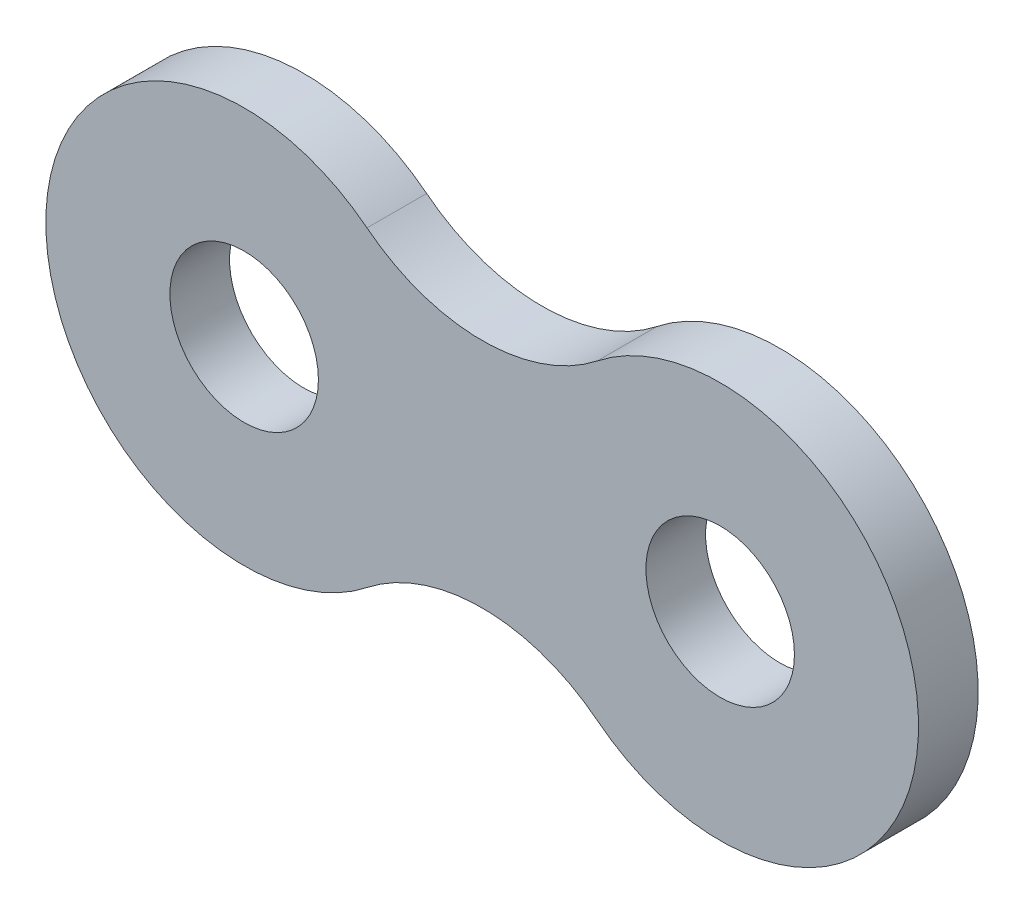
from build123d import *

# Parameters (mm, degrees)
SKETCH3_R          = 2.9718
BASE_EXTRUDE_DEPTH = 2.3876


with BuildPart() as part:
    # Sketch3 → Base-Extrude (new body)
    with BuildSketch(Plane.XY):
        with BuildLine():
            ThreePointArc((14.134224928, -6.2320993), (26.9875, 0), (14.134224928, 6.2320993))
            ThreePointArc((14.134224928, 6.2320993), (9.525, 4.633048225), (4.915775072, 6.2320993))
            ThreePointArc((4.915775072, 6.2320993), (-7.9375, 0), (4.915775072, -6.2320993))
            ThreePointArc((4.915775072, -6.2320993), (9.525, -4.633048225), (14.134224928, -6.2320993))
        make_face()
        Circle(SKETCH3_R, mode=Mode.SUBTRACT)
        with Locations((19.05, 0)):
            Circle(SKETCH3_R, mode=Mode.SUBTRACT)
    extrude(amount=BASE_EXTRUDE_DEPTH)


solid = part.part
